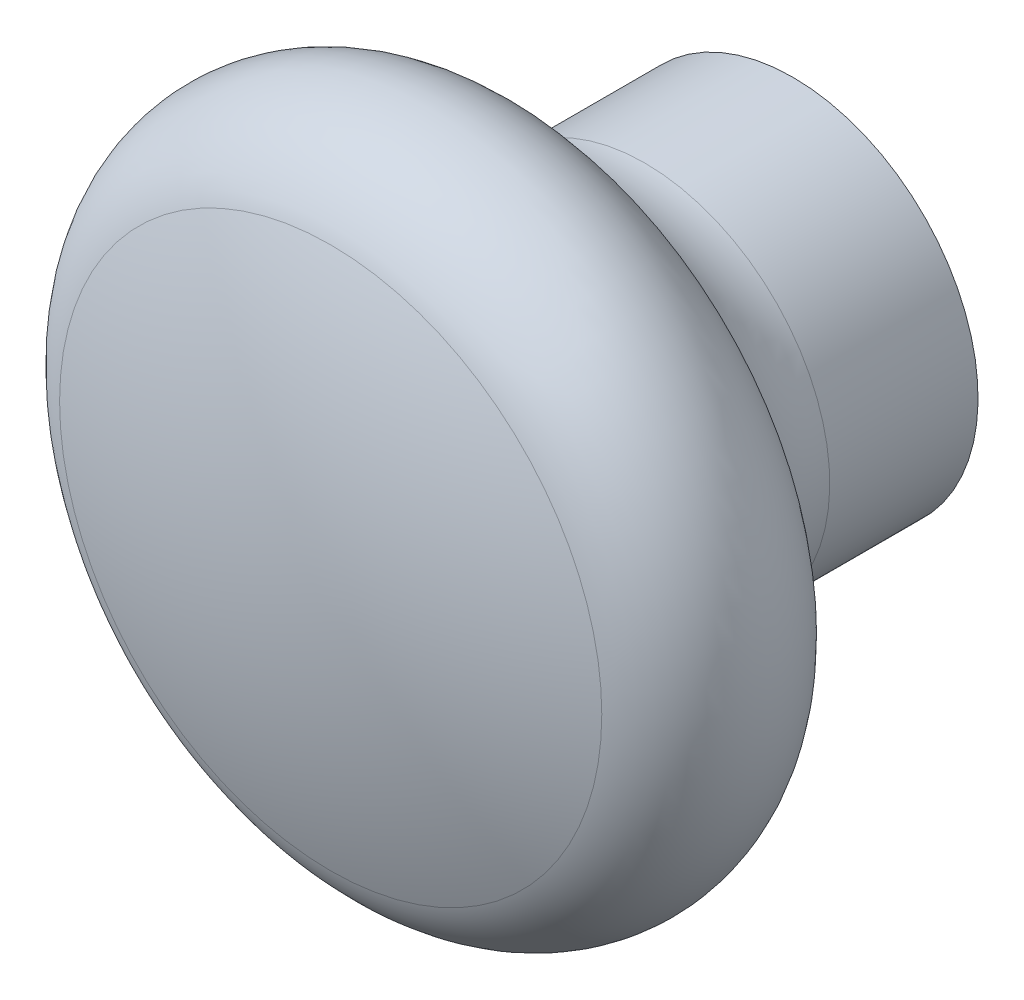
ISO-10303-21;
HEADER;
FILE_DESCRIPTION(('STEP AP214'),'2;1');
FILE_NAME('part.step','',(''),(''),'','','');
FILE_SCHEMA(('AUTOMOTIVE_DESIGN { 1 0 10303 214 1 1 1 1 }'));
ENDSEC;
DATA;
#1=APPLICATION_CONTEXT('core data for automotive mechanical design processes');
#2=APPLICATION_PROTOCOL_DEFINITION('international standard','automotive_design',2000,#1);
#3=PRODUCT_CONTEXT('',#1,'mechanical');
#4=PRODUCT('Part','Part','',(#3));
#5=PRODUCT_RELATED_PRODUCT_CATEGORY('part','',(#4));
#6=PRODUCT_DEFINITION_FORMATION('','',#4);
#7=PRODUCT_DEFINITION_CONTEXT('part definition',#1,'design');
#8=PRODUCT_DEFINITION('design','',#6,#7);
#9=PRODUCT_DEFINITION_SHAPE('','',#8);
#10=(LENGTH_UNIT() NAMED_UNIT(*) SI_UNIT(.MILLI.,.METRE.));
#11=(NAMED_UNIT(*) PLANE_ANGLE_UNIT() SI_UNIT($,.RADIAN.));
#12=(NAMED_UNIT(*) SI_UNIT($,.STERADIAN.) SOLID_ANGLE_UNIT());
#13=UNCERTAINTY_MEASURE_WITH_UNIT(LENGTH_MEASURE(1.E-05),#10,'distance_accuracy_value','');
#14=(GEOMETRIC_REPRESENTATION_CONTEXT(3) GLOBAL_UNCERTAINTY_ASSIGNED_CONTEXT((#13)) GLOBAL_UNIT_ASSIGNED_CONTEXT((#10,
#11,#12)) REPRESENTATION_CONTEXT('',''));
#15=CARTESIAN_POINT('',(0.,0.,0.));
#16=DIRECTION('',(0.,0.,1.));
#17=DIRECTION('',(1.,0.,0.));
#18=AXIS2_PLACEMENT_3D('',#15,#16,#17);
#19=CARTESIAN_POINT('',(0.,0.,-13.));
#20=DIRECTION('',(0.,0.,-1.));
#21=DIRECTION('',(1.,0.,0.));
#22=AXIS2_PLACEMENT_3D('',#19,#20,#21);
#23=SPHERICAL_SURFACE('',#22,40.);
#24=CARTESIAN_POINT('',(0.,0.,24.5023628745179));
#25=DIRECTION('',(0.,0.,-1.));
#26=DIRECTION('',(0.,1.,0.));
#27=AXIS2_PLACEMENT_3D('',#24,#25,#26);
#28=CIRCLE('',#27,13.9130434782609);
#29=CARTESIAN_POINT('',(0.,13.9130434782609,24.5023628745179));
#30=VERTEX_POINT('',#29);
#31=EDGE_CURVE('E43',#30,#30,#28,.T.);
#32=ORIENTED_EDGE('',*,*,#31,.F.);
#33=EDGE_LOOP('',(#32));
#34=FACE_BOUND('',#33,.T.);
#35=ADVANCED_FACE('F12',(#34),#23,.T.);
#36=CARTESIAN_POINT('',(4.,0.,15.));
#37=DIRECTION('',(0.,0.,-1.));
#38=DIRECTION('',(0.,1.,0.));
#39=AXIS2_PLACEMENT_3D('',#36,#37,#38);
#40=PLANE('',#39);
#41=CARTESIAN_POINT('',(0.,0.,15.));
#42=DIRECTION('',(0.,0.,-1.));
#43=DIRECTION('',(0.,1.,0.));
#44=AXIS2_PLACEMENT_3D('',#41,#42,#43);
#45=CIRCLE('',#44,4.);
#46=CARTESIAN_POINT('',(0.,4.,15.));
#47=VERTEX_POINT('',#46);
#48=EDGE_CURVE('E8',#47,#47,#45,.T.);
#49=ORIENTED_EDGE('',*,*,#48,.T.);
#50=EDGE_LOOP('',(#49));
#51=FACE_BOUND('',#50,.T.);
#52=ADVANCED_FACE('F51',(#51),#40,.T.);
#53=CARTESIAN_POINT('',(0.,0.,0.));
#54=DIRECTION('',(0.,0.,-1.));
#55=DIRECTION('',(0.,1.,0.));
#56=AXIS2_PLACEMENT_3D('',#53,#54,#55);
#57=CYLINDRICAL_SURFACE('',#56,4.);
#58=CARTESIAN_POINT('',(0.,0.,3.5));
#59=DIRECTION('',(0.,0.,-1.));
#60=DIRECTION('',(0.,1.,0.));
#61=AXIS2_PLACEMENT_3D('',#58,#59,#60);
#62=CIRCLE('',#61,4.);
#63=CARTESIAN_POINT('',(0.,4.,3.5));
#64=VERTEX_POINT('',#63);
#65=EDGE_CURVE('E18',#64,#64,#62,.T.);
#66=ORIENTED_EDGE('',*,*,#65,.T.);
#67=EDGE_LOOP('',(#66));
#68=FACE_BOUND('',#67,.T.);
#69=ORIENTED_EDGE('',*,*,#48,.F.);
#70=EDGE_LOOP('',(#69));
#71=FACE_BOUND('',#70,.T.);
#72=ADVANCED_FACE('F57',(#68,#71),#57,.F.);
#73=CARTESIAN_POINT('',(4.25,0.,3.5));
#74=DIRECTION('',(0.,0.,-1.));
#75=DIRECTION('',(0.,1.,0.));
#76=AXIS2_PLACEMENT_3D('',#73,#74,#75);
#77=PLANE('',#76);
#78=CARTESIAN_POINT('',(0.,0.,3.5));
#79=DIRECTION('',(0.,0.,-1.));
#80=DIRECTION('',(0.,1.,0.));
#81=AXIS2_PLACEMENT_3D('',#78,#79,#80);
#82=CIRCLE('',#81,4.25);
#83=CARTESIAN_POINT('',(0.,4.25,3.5));
#84=VERTEX_POINT('',#83);
#85=EDGE_CURVE('E22',#84,#84,#82,.T.);
#86=ORIENTED_EDGE('',*,*,#85,.T.);
#87=EDGE_LOOP('',(#86));
#88=FACE_BOUND('',#87,.T.);
#89=ORIENTED_EDGE('',*,*,#65,.F.);
#90=EDGE_LOOP('',(#89));
#91=FACE_BOUND('',#90,.T.);
#92=ADVANCED_FACE('F62',(#88,#91),#77,.T.);
#93=CARTESIAN_POINT('',(0.,0.,0.));
#94=DIRECTION('',(0.,0.,-1.));
#95=DIRECTION('',(0.,1.,0.));
#96=AXIS2_PLACEMENT_3D('',#93,#94,#95);
#97=CYLINDRICAL_SURFACE('',#96,4.25);
#98=CARTESIAN_POINT('',(0.,0.,0.));
#99=DIRECTION('',(0.,0.,-1.));
#100=DIRECTION('',(0.,1.,0.));
#101=AXIS2_PLACEMENT_3D('',#98,#99,#100);
#102=CIRCLE('',#101,4.25);
#103=CARTESIAN_POINT('',(0.,4.25,0.));
#104=VERTEX_POINT('',#103);
#105=EDGE_CURVE('E26',#104,#104,#102,.T.);
#106=ORIENTED_EDGE('',*,*,#105,.T.);
#107=EDGE_LOOP('',(#106));
#108=FACE_BOUND('',#107,.T.);
#109=ORIENTED_EDGE('',*,*,#85,.F.);
#110=EDGE_LOOP('',(#109));
#111=FACE_BOUND('',#110,.T.);
#112=ADVANCED_FACE('F67',(#108,#111),#97,.F.);
#113=CARTESIAN_POINT('',(4.25,0.,0.));
#114=DIRECTION('',(0.,0.,-1.));
#115=DIRECTION('',(0.,1.,0.));
#116=AXIS2_PLACEMENT_3D('',#113,#114,#115);
#117=PLANE('',#116);
#118=CARTESIAN_POINT('',(0.,0.,0.));
#119=DIRECTION('',(0.,0.,-1.));
#120=DIRECTION('',(0.,1.,0.));
#121=AXIS2_PLACEMENT_3D('',#118,#119,#120);
#122=CIRCLE('',#121,8.22436181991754);
#123=CARTESIAN_POINT('',(0.,8.22436181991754,0.));
#124=VERTEX_POINT('',#123);
#125=EDGE_CURVE('E31',#124,#124,#122,.T.);
#126=ORIENTED_EDGE('',*,*,#125,.T.);
#127=EDGE_LOOP('',(#126));
#128=FACE_BOUND('',#127,.T.);
#129=ORIENTED_EDGE('',*,*,#105,.F.);
#130=EDGE_LOOP('',(#129));
#131=FACE_BOUND('',#130,.T.);
#132=ADVANCED_FACE('F71',(#128,#131),#117,.T.);
#133=CARTESIAN_POINT('',(0.,0.,0.));
#134=DIRECTION('',(0.,0.,1.));
#135=DIRECTION('',(0.,-1.,0.));
#136=AXIS2_PLACEMENT_3D('',#133,#134,#135);
#137=CONICAL_SURFACE('',#136,8.22436181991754,1.02199392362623);
#138=CARTESIAN_POINT('',(0.,0.,0.78000000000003));
#139=DIRECTION('',(0.,0.,-1.));
#140=DIRECTION('',(0.,1.,0.));
#141=AXIS2_PLACEMENT_3D('',#138,#139,#140);
#142=CIRCLE('',#141,9.5);
#143=CARTESIAN_POINT('',(0.,9.5,0.78000000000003));
#144=VERTEX_POINT('',#143);
#145=EDGE_CURVE('E34',#144,#144,#142,.T.);
#146=ORIENTED_EDGE('',*,*,#145,.T.);
#147=EDGE_LOOP('',(#146));
#148=FACE_BOUND('',#147,.T.);
#149=ORIENTED_EDGE('',*,*,#125,.F.);
#150=EDGE_LOOP('',(#149));
#151=FACE_BOUND('',#150,.T.);
#152=ADVANCED_FACE('F75',(#148,#151),#137,.T.);
#153=CARTESIAN_POINT('',(0.,0.,0.));
#154=DIRECTION('',(0.,0.,-1.));
#155=DIRECTION('',(0.,1.,0.));
#156=AXIS2_PLACEMENT_3D('',#153,#154,#155);
#157=CYLINDRICAL_SURFACE('',#156,9.5);
#158=CARTESIAN_POINT('',(0.,0.,8.39133682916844));
#159=DIRECTION('',(0.,0.,-1.));
#160=DIRECTION('',(0.,1.,0.));
#161=AXIS2_PLACEMENT_3D('',#158,#159,#160);
#162=CIRCLE('',#161,9.5);
#163=CARTESIAN_POINT('',(0.,9.5,8.39133682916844));
#164=VERTEX_POINT('',#163);
#165=EDGE_CURVE('E37',#164,#164,#162,.T.);
#166=ORIENTED_EDGE('',*,*,#165,.T.);
#167=EDGE_LOOP('',(#166));
#168=FACE_BOUND('',#167,.T.);
#169=ORIENTED_EDGE('',*,*,#145,.F.);
#170=EDGE_LOOP('',(#169));
#171=FACE_BOUND('',#170,.T.);
#172=ADVANCED_FACE('F79',(#168,#171),#157,.T.);
#173=CARTESIAN_POINT('',(0.,0.,8.39133682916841));
#174=DIRECTION('',(0.,0.,-1.));
#175=DIRECTION('',(0.,1.,0.));
#176=AXIS2_PLACEMENT_3D('',#173,#174,#175);
#177=TOROIDAL_SURFACE('',#176,15.5,6.);
#178=CARTESIAN_POINT('',(0.,0.,14.1067026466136));
#179=DIRECTION('',(0.,0.,-1.));
#180=DIRECTION('',(0.,1.,0.));
#181=AXIS2_PLACEMENT_3D('',#178,#179,#180);
#182=CIRCLE('',#181,13.6739130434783);
#183=CARTESIAN_POINT('',(0.,13.6739130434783,14.1067026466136));
#184=VERTEX_POINT('',#183);
#185=EDGE_CURVE('E40',#184,#184,#182,.T.);
#186=ORIENTED_EDGE('',*,*,#185,.T.);
#187=EDGE_LOOP('',(#186));
#188=FACE_BOUND('',#187,.T.);
#189=ORIENTED_EDGE('',*,*,#165,.F.);
#190=EDGE_LOOP('',(#189));
#191=FACE_BOUND('',#190,.T.);
#192=ADVANCED_FACE('F83',(#188,#191),#177,.F.);
#193=CARTESIAN_POINT('',(0.,0.,19.3457879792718));
#194=DIRECTION('',(0.,0.,-1.));
#195=DIRECTION('',(0.,1.,0.));
#196=AXIS2_PLACEMENT_3D('',#193,#194,#195);
#197=TOROIDAL_SURFACE('',#196,12.,5.5);
#198=ORIENTED_EDGE('',*,*,#31,.T.);
#199=EDGE_LOOP('',(#198));
#200=FACE_BOUND('',#199,.T.);
#201=ORIENTED_EDGE('',*,*,#185,.F.);
#202=EDGE_LOOP('',(#201));
#203=FACE_BOUND('',#202,.T.);
#204=ADVANCED_FACE('F47',(#200,#203),#197,.T.);
#205=CLOSED_SHELL('',(#35,#52,#72,#92,#112,#132,#152,#172,#192,#204));
#206=MANIFOLD_SOLID_BREP('B1',#205);
#207=ADVANCED_BREP_SHAPE_REPRESENTATION('',(#18,#206),#14);
#208=SHAPE_DEFINITION_REPRESENTATION(#9,#207);
ENDSEC;
END-ISO-10303-21;
